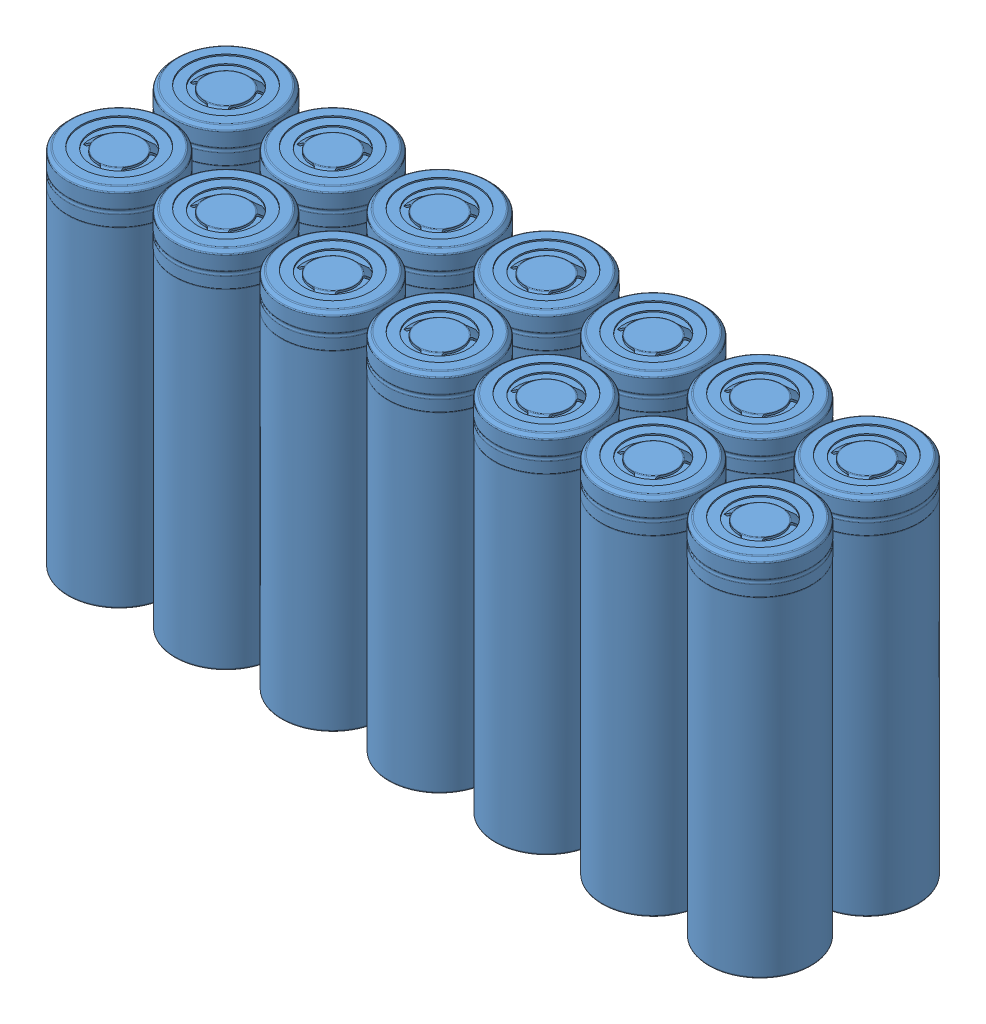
SolidWorks assembly 18650-6s2p_Stacked_v1.SLDASM, configuration Default (file format 12000). Lengths in mm.
Overall size (132.68 64.95 37.43).
20 component instances, 1 part files, 3 mates.
Components (placement in the parent):
- Samsung INR18650-29R-1: Samsung INR18650-29R.SLDPRT [Standard] at (12.9292 41.5757 50.6069) size (18.38 64.95 18.38)
- Samsung INR18650-29R-4: Samsung INR18650-29R.SLDPRT [Standard] at (31.9792 41.5757 50.6069) size (18.38 64.95 18.38)
- Samsung INR18650-29R-5: Samsung INR18650-29R.SLDPRT [Standard] at (51.0292 41.5757 50.6069) size (18.38 64.95 18.38)
- Samsung INR18650-29R-6: Samsung INR18650-29R.SLDPRT [Standard] at (70.0792 41.5757 50.6069) size (18.38 64.95 18.38)
- Samsung INR18650-29R-7: Samsung INR18650-29R.SLDPRT [Standard] at (89.1292 41.5757 50.6069) size (18.38 64.95 18.38)
- Samsung INR18650-29R-8: Samsung INR18650-29R.SLDPRT [Standard] at (108.1792 41.5757 50.6069) size (18.38 64.95 18.38)
- Samsung INR18650-29R-14: Samsung INR18650-29R.SLDPRT [Standard] at (22.4542 41.5757 34.9577) x (0.930469 0 -0.366372) z (0.366372 0 0.930469) size (18.38 64.95 18.38) (suppressed, hidden)
- Samsung INR18650-29R-15: Samsung INR18650-29R.SLDPRT [Standard] at (41.5042 41.5757 34.9577) x (0.930469 0 -0.366372) z (0.366372 0 0.930469) size (18.38 64.95 18.38) (suppressed, hidden)
- Samsung INR18650-29R-16: Samsung INR18650-29R.SLDPRT [Standard] at (60.5542 41.5757 34.9577) x (0.930469 0 -0.366372) z (0.366372 0 0.930469) size (18.38 64.95 18.38) (suppressed, hidden)
- Samsung INR18650-29R-17: Samsung INR18650-29R.SLDPRT [Standard] at (79.6042 41.5757 34.9577) x (0.930469 0 -0.366372) z (0.366372 0 0.930469) size (18.38 64.95 18.38) (suppressed, hidden)
- Samsung INR18650-29R-18: Samsung INR18650-29R.SLDPRT [Standard] at (98.6542 41.5757 34.9577) x (0.930469 0 -0.366372) z (0.366372 0 0.930469) size (18.38 64.95 18.38) (suppressed, hidden)
- Samsung INR18650-29R-19: Samsung INR18650-29R.SLDPRT [Standard] at (117.7042 41.5757 34.9577) x (0.930469 0 -0.366372) z (0.366372 0 0.930469) size (18.38 64.95 18.38) (suppressed, hidden)
- Samsung INR18650-29R-20: Samsung INR18650-29R.SLDPRT [Standard] at (12.9292 41.5757 69.6569) size (18.38 64.95 18.38)
- Samsung INR18650-29R-21: Samsung INR18650-29R.SLDPRT [Standard] at (31.9792 41.5757 69.6569) size (18.38 64.95 18.38)
- Samsung INR18650-29R-22: Samsung INR18650-29R.SLDPRT [Standard] at (51.0292 41.5757 69.6569) size (18.38 64.95 18.38)
- Samsung INR18650-29R-23: Samsung INR18650-29R.SLDPRT [Standard] at (70.0792 41.5757 69.6569) size (18.38 64.95 18.38)
- Samsung INR18650-29R-24: Samsung INR18650-29R.SLDPRT [Standard] at (89.1292 41.5757 69.6569) size (18.38 64.95 18.38)
- Samsung INR18650-29R-25: Samsung INR18650-29R.SLDPRT [Standard] at (108.1792 41.5757 69.6569) size (18.38 64.95 18.38)
- Samsung INR18650-29R-26: Samsung INR18650-29R.SLDPRT [Standard] at (127.2292 41.5757 50.6069) size (18.38 64.95 18.38)
- Samsung INR18650-29R-27: Samsung INR18650-29R.SLDPRT [Standard] at (127.2292 41.5757 69.6569) size (18.38 64.95 18.38)
Mates (geometry in assembly coordinates):
- Tangent1: tangent anti-aligned: cylinder of Samsung INR18650-29R-1 through (12.9292 108.1724 50.6069) axis (0 1 0) radius 9.16; cylinder of Samsung INR18650-29R-14 through (22.4542 108.1724 34.9577) axis (0 1 0) radius 9.16
- Coincident1: coincident aligned: plane of Samsung INR18650-29R-1 through (12.9292 79.1996 50.6069) normal (0 1 0); plane of Samsung INR18650-29R-14 through (22.4542 79.1996 34.9577) normal (0 1 0)
- Tangent2: tangent anti-aligned: cylinder of Samsung INR18650-29R-4 through (31.9792 108.1724 50.6069) axis (0 1 0) radius 9.16; cylinder of Samsung INR18650-29R-14 through (22.4542 108.1724 34.9577) axis (0 1 0) radius 9.16
